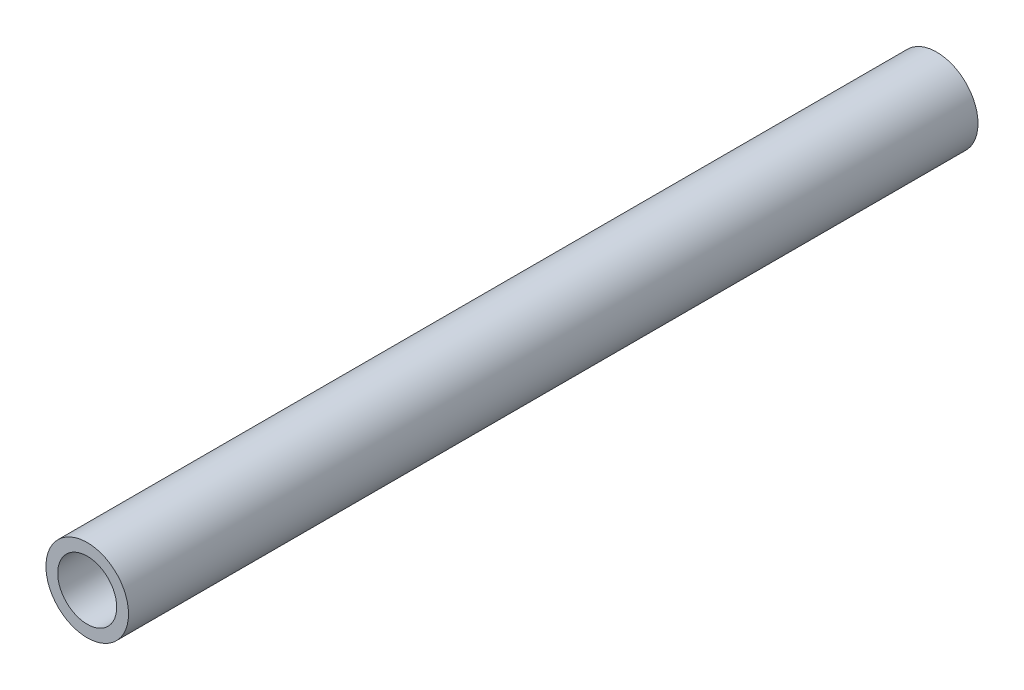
from build123d import *

# Parameters (mm, degrees)
SKETCH1_R      = 11.1125
EXTRUDE1_DEPTH = 228.6
SKETCH2_R      = 7.9375
EXTRUDE2_DEPTH = 230.13955423


with BuildPart() as part:
    # Sketch1 → Extrude1 (new body)
    with BuildSketch(Plane.XY):
        Circle(SKETCH1_R)
    extrude(amount=EXTRUDE1_DEPTH)

    # Sketch2 → Extrude2 (cut, through all)
    with BuildSketch(Plane.XY.offset(228.6)):
        Circle(SKETCH2_R)
    extrude(amount=-EXTRUDE2_DEPTH, mode=Mode.SUBTRACT)


solid = part.part
